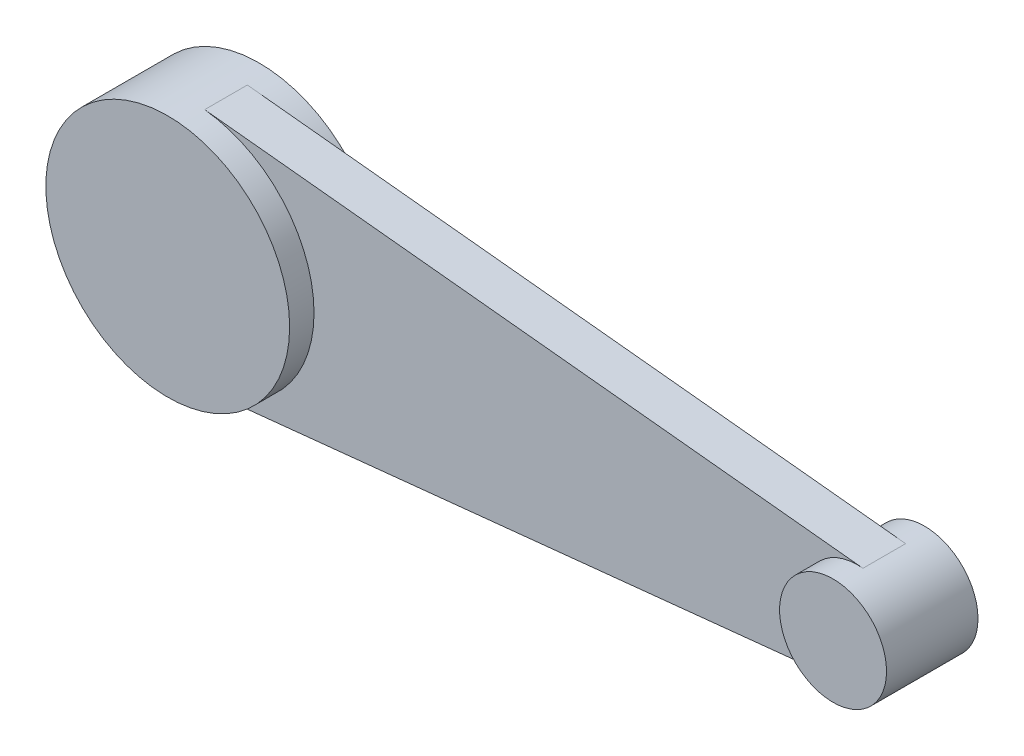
from build123d import *

# Parameters (mm, degrees)
SKETCH1_R        = 25.390838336
EXTRUDE1_DEPTH   = 9.525
SKETCH1_R_2      = 11.139000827
EXTRUDE1_2_DEPTH = 9.525
EXTRUDE2_DEPTH   = 4.445


with BuildPart() as part:
    # Sketch1 → Extrude1 (new, symmetric)
    with BuildSketch(Plane.XY):
        with Locations((-81.872176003, 0)):
            Circle(SKETCH1_R)
    extrude(amount=EXTRUDE1_DEPTH, both=True)



with BuildPart() as body_2:
    # Sketch1 → Extrude1 2 (new, symmetric)
    with BuildSketch(Plane.XY):
        with Locations((56.700295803, 0)):
            Circle(SKETCH1_R_2)
    extrude(amount=EXTRUDE1_2_DEPTH, both=True)


with BuildPart() as part_1:
    add(part.part)

    add(body_2.part)  # Extrude2 merges body 2
    # Sketch2 → Extrude2 (add, symmetric)
    with BuildSketch(Plane.XY):
        with BuildLine():
            Line((-79.260790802, 25.256194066), (57.84591461, 11.079932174))
            ThreePointArc((57.84591461, 11.079932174), (45.561294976, 0), (57.84591461, -11.079932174))
            Line((57.84591461, -11.079932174), (-79.260790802, -25.256194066))
            ThreePointArc((-79.260790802, -25.256194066), (-56.481337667, 0), (-79.260790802, 25.256194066))
        make_face()
    extrude(amount=EXTRUDE2_DEPTH, both=True)


solid = part_1.part
